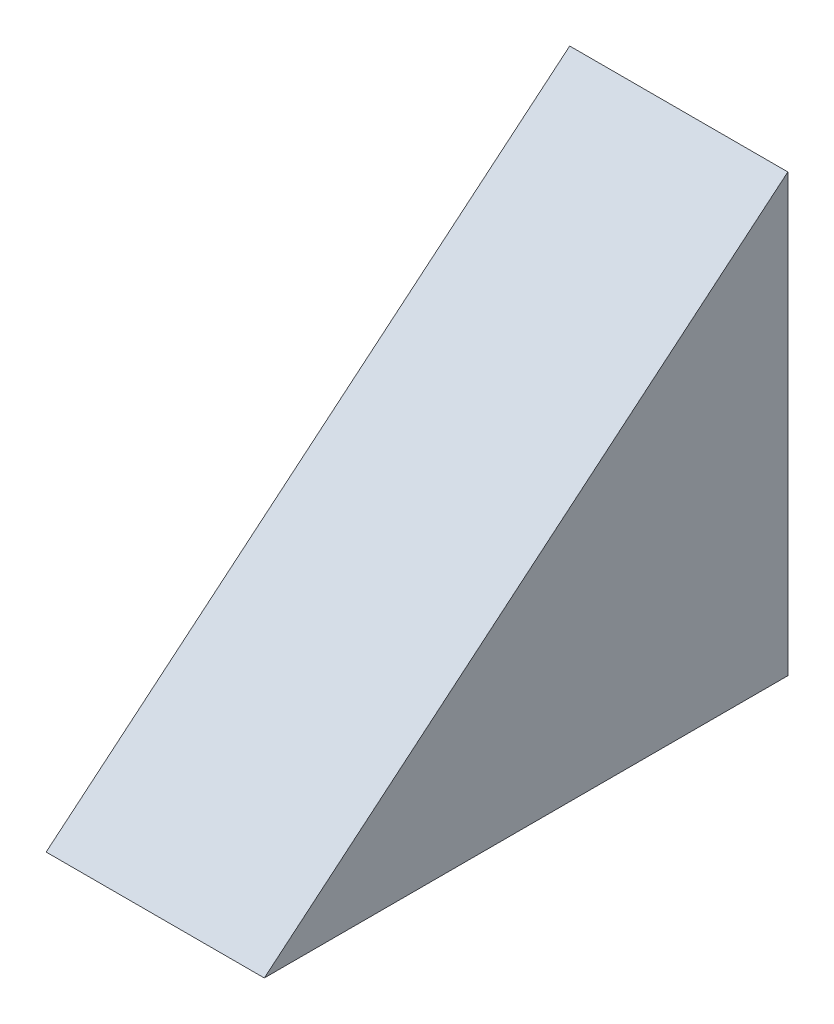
from build123d import *

# Parameters (mm, degrees)
EXTRUDE_8_DEPTH = 2.5


with BuildPart() as part:
    # Sketch 3 → Extrude 8 (new, symmetric)
    with BuildSketch(Plane(origin=(0, 0, 0), x_dir=(0, 0, -1), z_dir=(1, 0, 0))):
        Polygon((-8, 18), (-20, 8), (-8, 8), align=None)
    extrude(amount=EXTRUDE_8_DEPTH, both=True)


solid = part.part
